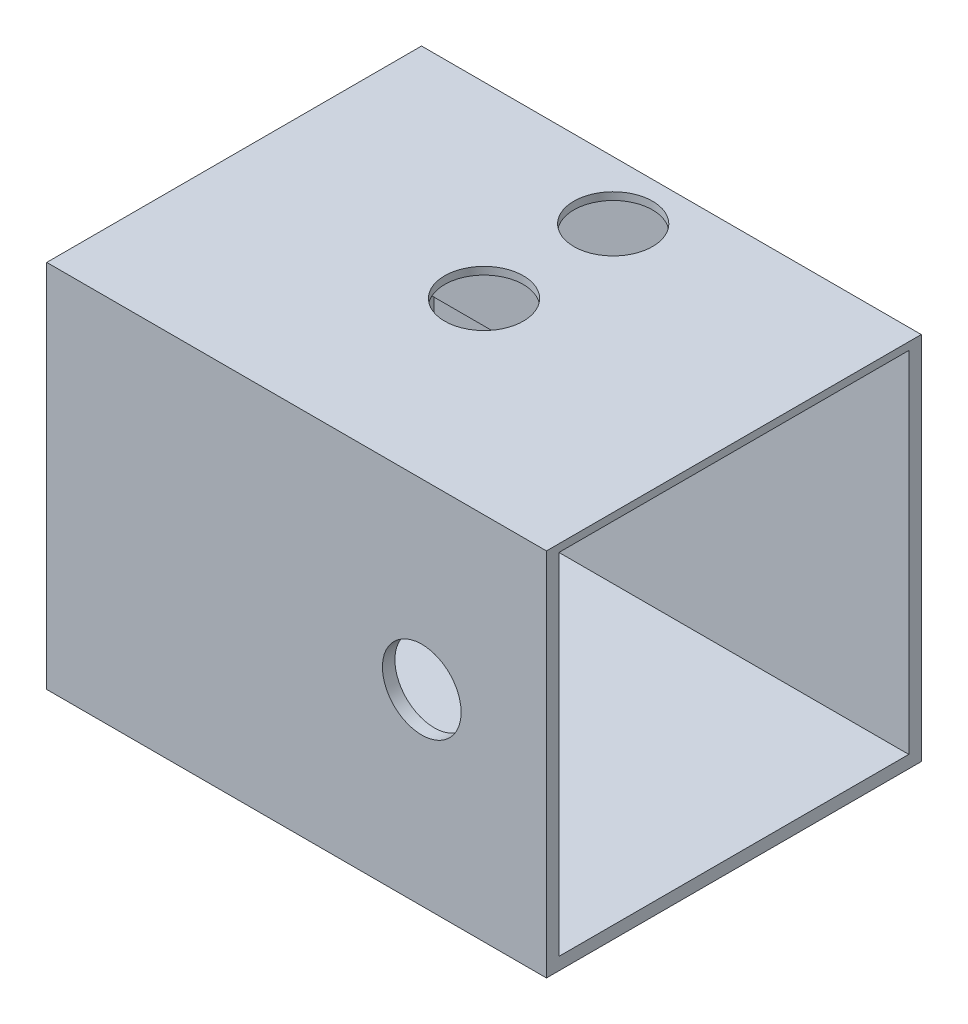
from build123d import *

# Parameters (mm, degrees)
SKETCH1_W           = 50.8
SKETCH1_H           = 38.1
BOSS_EXTRUDE2_DEPTH = 38.1
SKETCH3_W           = 17.78
SKETCH3_H           = 17.78
CUT_EXTRUDE1_DEPTH  = 48.26
SKETCH4_R           = 4
CUT_EXTRUDE2_DEPTH  = 10
SKETCH5_W           = 14
SKETCH5_H           = 8
CUT_EXTRUDE3_DEPTH  = 10
SKETCH6_R           = 4
CUT_EXTRUDE4_DEPTH  = 10
SKETCH8_W           = 2
SKETCH8_H           = 6
SKETCH8_H_2         = 6.155103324
BOSS_EXTRUDE3_DEPTH = 42
SKETCH9_W           = 50.8
SKETCH9_H           = 38.1
CUT_EXTRUDE5_DEPTH  = 0.5
SKETCH10_W          = 11.225074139
SKETCH10_H          = 0.77
BOSS_EXTRUDE4_DEPTH = 17.5
SKETCH11_R          = 4
CUT_EXTRUDE6_DEPTH  = 17.5


with BuildPart() as part:
    # Sketch1 → Boss-Extrude2 (new body)
    with BuildSketch(Plane.XY):
        Rectangle(SKETCH1_W, SKETCH1_H)
    extrude(amount=BOSS_EXTRUDE2_DEPTH)

    # Sketch3 → Cut-Extrude1 (cut)
    with BuildSketch(Plane(origin=(25.4, 0, 0), x_dir=(0, 0, -1), z_dir=(1, 0, 0))):
        with Locations((-27.94, 8.89)):
            Rectangle(SKETCH3_W, SKETCH3_H)
        with Locations((-10.16, 8.89)):
            Rectangle(SKETCH3_W, SKETCH3_H)
        with Locations((-10.16, -8.89)):
            Rectangle(SKETCH3_W, SKETCH3_H)
        with Locations((-27.94, -8.89)):
            Rectangle(SKETCH3_W, SKETCH3_H)
    extrude(amount=-CUT_EXTRUDE1_DEPTH, mode=Mode.SUBTRACT)

    # Sketch4 → Cut-Extrude2 (cut)
    with BuildSketch(Plane(origin=(0, 19.05, 0), x_dir=(1, 0, 0), z_dir=(0, 1, 0))):
        with Locations(Location((0, -19.05, 0), (0, 0, 270))):
            Circle(SKETCH4_R)
    extrude(amount=-CUT_EXTRUDE2_DEPTH, mode=Mode.SUBTRACT)

    # Sketch5 → Cut-Extrude3 (cut)
    with BuildSketch(Plane(origin=(0, 19.05, 0), x_dir=(1, 0, 0), z_dir=(0, 1, 0))):
        with Locations((0.019579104, -6.186558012)):
            Rectangle(SKETCH5_W, SKETCH5_H)
    extrude(amount=-CUT_EXTRUDE3_DEPTH, mode=Mode.SUBTRACT)

    # Sketch6 → Cut-Extrude4 (cut)
    with BuildSketch(Plane.XY.offset(38.1)):
        with Locations((12.722987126, 0)):
            Circle(SKETCH6_R)
    extrude(amount=-CUT_EXTRUDE4_DEPTH, mode=Mode.SUBTRACT)

    # Sketch8 → Boss-Extrude3 (add)
    with BuildSketch(Plane(origin=(-22.86, 0, 0), x_dir=(0, 0, -1), z_dir=(1, 0, 0))):
        with Locations((-13.701982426, 14.78)):
            Rectangle(SKETCH8_W, SKETCH8_H)
        with Locations((-24.897300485, 14.702448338)):
            Rectangle(SKETCH8_W, SKETCH8_H_2)
    extrude(amount=BOSS_EXTRUDE3_DEPTH)

    # Sketch9 → Cut-Extrude5 (cut)
    with BuildSketch(Plane(origin=(0, 19.05, 0), x_dir=(1, 0, 0), z_dir=(0, 1, 0))):
        with Locations((0, -19.05)):
            Rectangle(SKETCH9_W, SKETCH9_H)
    extrude(amount=-CUT_EXTRUDE5_DEPTH, mode=Mode.SUBTRACT)

    # Sketch10 → Boss-Extrude4 (add)
    with BuildSketch(Plane(origin=(-6.980420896, 0, 0), x_dir=(0, 0, -1), z_dir=(1, 0, 0))):
        with Locations((-5.61253707, 18.165)):
            Rectangle(SKETCH10_W, SKETCH10_H)
    extrude(amount=BOSS_EXTRUDE4_DEPTH)

    # Sketch11 → Cut-Extrude6 (cut)
    with BuildSketch(Plane(origin=(0, 18.55, 0), x_dir=(1, 0, 0), z_dir=(0, 1, 0))):
        with Locations(Location((0, -5.915709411, 0), (0, 0, 270))):
            Circle(SKETCH11_R)
    extrude(amount=-CUT_EXTRUDE6_DEPTH, mode=Mode.SUBTRACT)


solid = part.part
